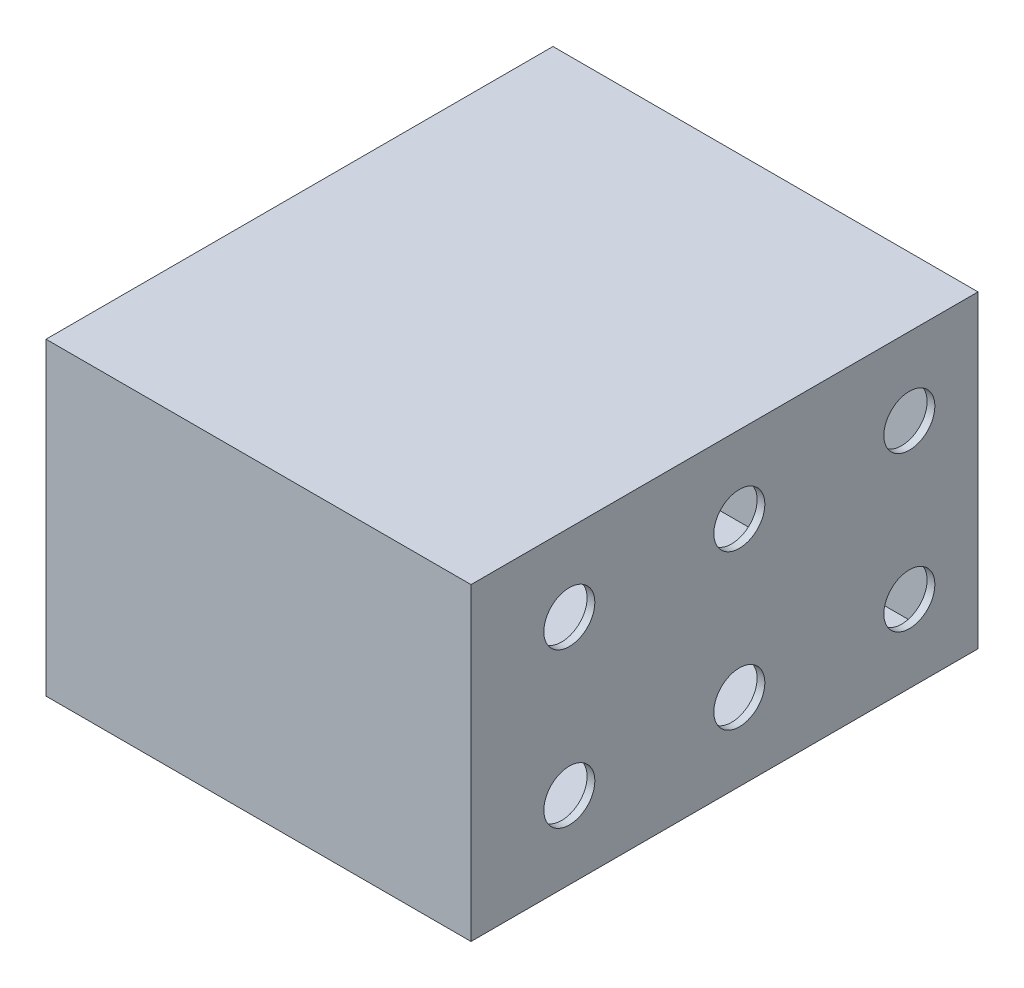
from build123d import *

# Parameters (mm, degrees)
SALIENTE_EXTRUIR4_DEPTH = 27.5
CROQUIS6_W              = 19.279085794
CROQUIS6_H              = 31.023865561
CORTAR_EXTRUIR1_DEPTH   = 27
CROQUIS8_R              = 1.65
CORTAR_EXTRUIR3_DEPTH   = 1
MATRIZL1_COUNT          = 3
MATRIZL1_PITCH          = 11


with BuildPart() as part:
    # Croquis5 → Saliente-Extruir4 (new body)
    with BuildSketch(Plane.YZ):
        Polygon((0, 0), (0, 2.80262364), (20, 2.80262364), (20, 0), (20, -30), (0, -30), align=None)
    extrude(amount=SALIENTE_EXTRUIR4_DEPTH)

    # Croquis6 → Cortar-Extruir1 (cut)
    with BuildSketch(Plane(origin=(0, 0, 0), x_dir=(0, -1, 0), z_dir=(-1, 0, 0))):
        with Locations((-10, -13.521312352)):
            Rectangle(CROQUIS6_W, CROQUIS6_H)
    extrude(amount=-CORTAR_EXTRUIR1_DEPTH, mode=Mode.SUBTRACT)

    # Croquis8 → Cortar-Extruir3 (cut)
    with BuildSketch(Plane.YZ.offset(27.5)):
        with Locations(Location((5, -3.558401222, 0), (0, 0, 270))):
            Circle(CROQUIS8_R)
        with Locations(Location((15, -3.558401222, 0), (0, 0, 270))):
            Circle(CROQUIS8_R)
    cortar_extruir3 = extrude(amount=-CORTAR_EXTRUIR3_DEPTH, mode=Mode.SUBTRACT)

    # MatrizL1: Cortar-Extruir3 ×3
    with Locations(*[(0, 0, -i * MATRIZL1_PITCH) for i in range(1, MATRIZL1_COUNT)]):
        add(cortar_extruir3, mode=Mode.SUBTRACT)


solid = part.part
